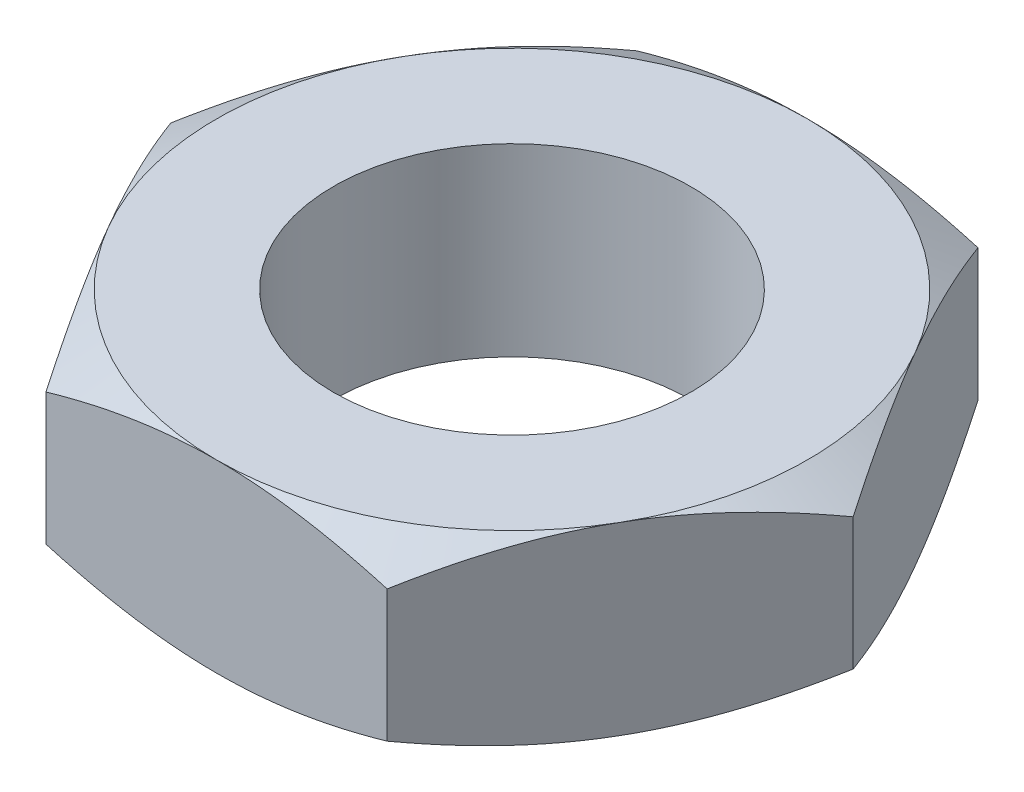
from build123d import *

# Parameters (mm, degrees)
BOSS_EXTRUDE1_DEPTH    = 7.5
M16X1_5_TAPPED_HOLE1_D = 14.5
SKETCH5_OUTSIDE_W      = 63.176
SKETCH5_OUTSIDE_H      = 59.464
SKETCH5_OUTSIDE_R      = 12
CUT_EXTRUDE1_DEPTH     = 7.5
CUT_EXTRUDE1_DRAFT     = -60
SKETCH6_OUTSIDE_W      = 63.176
SKETCH6_OUTSIDE_H      = 59.464
SKETCH6_OUTSIDE_R      = 12
CUT_EXTRUDE3_DEPTH     = 7.5
CUT_EXTRUDE3_DRAFT     = -60


with BuildPart() as part:
    # Sketch1 → Boss-Extrude1 (new body)
    with BuildSketch(Plane(origin=(0, 0, 0), x_dir=(1, 0, 0), z_dir=(0, 1, 0))):
        Polygon((6.92820323, -12), (13.856406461, 0), (6.92820323, 12), (-6.92820323, 12), (-13.856406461, 0), (-6.92820323, -12), align=None)
    extrude(amount=BOSS_EXTRUDE1_DEPTH)

    # M16x1.5 Tapped Hole1 (through all)
    with Locations(Plane(origin=(0, 7.5, 0), x_dir=(1, 0, 0), z_dir=(0, 1, 0))):
        with Locations((0, 0)):
            Hole(M16X1_5_TAPPED_HOLE1_D / 2)


with BuildPart() as cut_extrude1_tool:
    # Sketch5 outside → Cut-Extrude1 (with draft: the straight prism first)
    with BuildSketch(Plane(origin=(0, 7.5, 0), x_dir=(1, 0, 0), z_dir=(0, 1, 0))):
        Rectangle(SKETCH5_OUTSIDE_W, SKETCH5_OUTSIDE_H)
        Circle(SKETCH5_OUTSIDE_R, mode=Mode.SUBTRACT)
    extrude(amount=-CUT_EXTRUDE1_DEPTH)
    # Cut-Extrude1: the draft: its side faces are tilted about the plane it starts from
    cut_extrude1_sides = [cut_extrude1_tool.faces().sort_by_distance(p)[0] for p in [
        (0, 3.75, 29.732),
        (31.588, 3.75, 0),
        (0, 3.75, -29.732),
        (-31.588, 3.75, 0),
        (-12, 3.75, 0),
    ]]
    draft(cut_extrude1_sides, Plane(origin=(0, 7.5, 0), x_dir=(1, 0, 0), z_dir=(0, 1, 0)), CUT_EXTRUDE1_DRAFT)


with BuildPart() as part_1:
    add(part.part)

    # Cut-Extrude1: cut by cut_extrude1_tool
    add(cut_extrude1_tool.part, mode=Mode.SUBTRACT)


with BuildPart() as cut_extrude3_tool:
    # Sketch6 outside → Cut-Extrude3 (with draft: the straight prism first)
    with BuildSketch(Plane.XZ):
        Rectangle(SKETCH6_OUTSIDE_W, SKETCH6_OUTSIDE_H)
        Circle(SKETCH6_OUTSIDE_R, mode=Mode.SUBTRACT)
    extrude(amount=-CUT_EXTRUDE3_DEPTH)
    # Cut-Extrude3: the draft: its side faces are tilted about the plane it starts from
    cut_extrude3_sides = [cut_extrude3_tool.faces().sort_by_distance(p)[0] for p in [
        (0, 3.75, -29.732),
        (31.588, 3.75, 0),
        (0, 3.75, 29.732),
        (-31.588, 3.75, 0),
        (-12, 3.75, 0),
    ]]
    draft(cut_extrude3_sides, Plane.XZ, CUT_EXTRUDE3_DRAFT)


with BuildPart() as part_2:
    add(part_1.part)

    # Cut-Extrude3: cut by cut_extrude3_tool
    add(cut_extrude3_tool.part, mode=Mode.SUBTRACT)


solid = part_2.part
